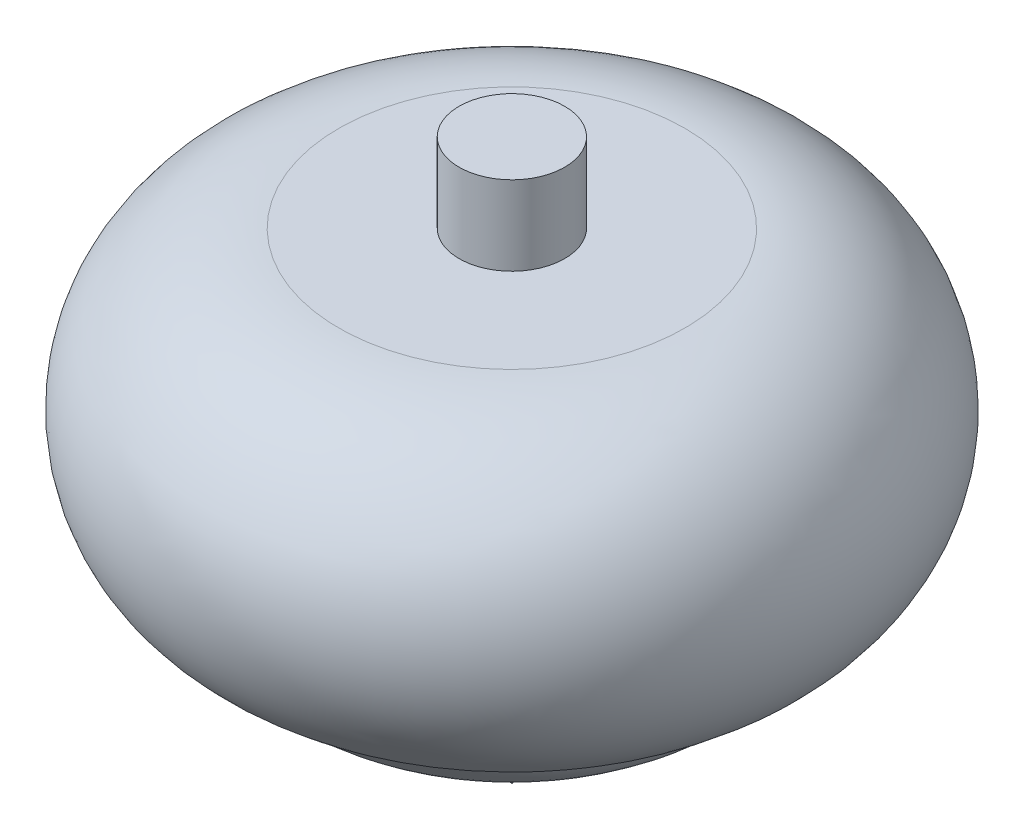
from build123d import *


with BuildPart() as part:
    # Sketch1 → Base-Revolve (revolve)
    with BuildSketch(Plane.XY, mode=Mode.PRIVATE) as base_revolve_sk:
        with BuildLine():
            Line((7.560700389, 68.886381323), (24.78229572, 68.886381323))
            ThreePointArc((24.78229572, 68.886381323), (46.818331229, 50.717609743), (33.18307393, 25.622373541))
            ThreePointArc((33.18307393, 25.622373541), (25.096971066, 18.39964768), (14.281322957, 17.641634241))
            Line((14.281322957, 17.641634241), (0, 0))
            Line((0, 0), (0, 80.227431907))
            Line((0, 80.227431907), (7.560700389, 80.227431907))
            Line((7.560700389, 80.227431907), (7.560700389, 68.886381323))
        make_face()
    revolve(base_revolve_sk.sketch.rotate(Axis((0, 0, 0), (0, 1, 0)), 90), axis=Axis((0, 0, 0), (0, 1, 0)))


solid = part.part
